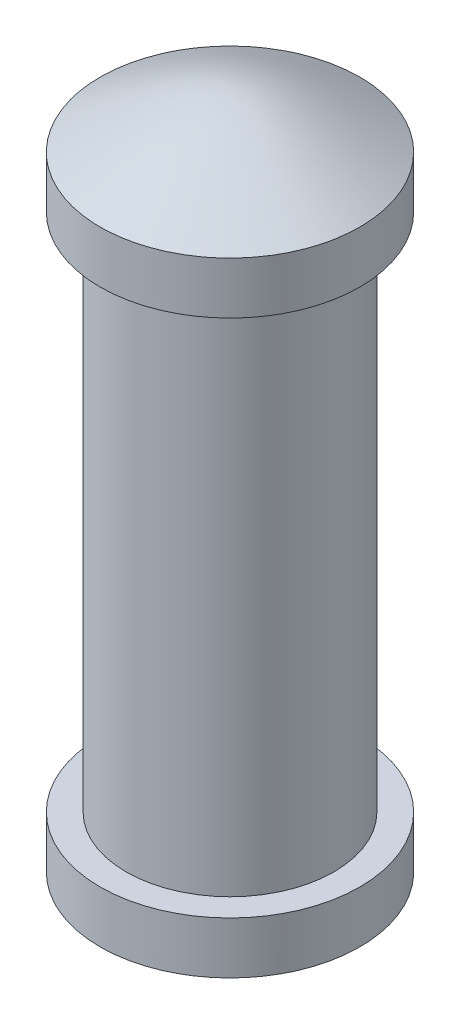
ISO-10303-21;
HEADER;
FILE_DESCRIPTION(('STEP AP214'),'2;1');
FILE_NAME('part.step','',(''),(''),'','','');
FILE_SCHEMA(('AUTOMOTIVE_DESIGN { 1 0 10303 214 1 1 1 1 }'));
ENDSEC;
DATA;
#1=APPLICATION_CONTEXT('core data for automotive mechanical design processes');
#2=APPLICATION_PROTOCOL_DEFINITION('international standard','automotive_design',2000,#1);
#3=PRODUCT_CONTEXT('',#1,'mechanical');
#4=PRODUCT('Part','Part','',(#3));
#5=PRODUCT_RELATED_PRODUCT_CATEGORY('part','',(#4));
#6=PRODUCT_DEFINITION_FORMATION('','',#4);
#7=PRODUCT_DEFINITION_CONTEXT('part definition',#1,'design');
#8=PRODUCT_DEFINITION('design','',#6,#7);
#9=PRODUCT_DEFINITION_SHAPE('','',#8);
#10=(LENGTH_UNIT() NAMED_UNIT(*) SI_UNIT(.MILLI.,.METRE.));
#11=(NAMED_UNIT(*) PLANE_ANGLE_UNIT() SI_UNIT($,.RADIAN.));
#12=(NAMED_UNIT(*) SI_UNIT($,.STERADIAN.) SOLID_ANGLE_UNIT());
#13=UNCERTAINTY_MEASURE_WITH_UNIT(LENGTH_MEASURE(1.E-05),#10,'distance_accuracy_value','');
#14=(GEOMETRIC_REPRESENTATION_CONTEXT(3) GLOBAL_UNCERTAINTY_ASSIGNED_CONTEXT((#13)) GLOBAL_UNIT_ASSIGNED_CONTEXT((#10,
#11,#12)) REPRESENTATION_CONTEXT('',''));
#15=CARTESIAN_POINT('',(0.,0.,0.));
#16=DIRECTION('',(0.,0.,1.));
#17=DIRECTION('',(1.,0.,0.));
#18=AXIS2_PLACEMENT_3D('',#15,#16,#17);
#19=CARTESIAN_POINT('',(0.,10.,0.));
#20=DIRECTION('',(0.,-1.,0.));
#21=DIRECTION('',(0.,0.,-1.));
#22=AXIS2_PLACEMENT_3D('',#19,#20,#21);
#23=CYLINDRICAL_SURFACE('',#22,2.);
#24=CARTESIAN_POINT('',(0.,10.,0.));
#25=DIRECTION('',(0.,1.,0.));
#26=DIRECTION('',(0.,0.,1.));
#27=AXIS2_PLACEMENT_3D('',#24,#25,#26);
#28=CIRCLE('',#27,2.);
#29=CARTESIAN_POINT('',(0.,10.,2.));
#30=VERTEX_POINT('',#29);
#31=EDGE_CURVE('E12',#30,#30,#28,.T.);
#32=ORIENTED_EDGE('',*,*,#31,.F.);
#33=EDGE_LOOP('',(#32));
#34=FACE_BOUND('',#33,.T.);
#35=CARTESIAN_POINT('',(0.,0.,0.));
#36=DIRECTION('',(0.,-1.,0.));
#37=DIRECTION('',(0.,0.,-1.));
#38=AXIS2_PLACEMENT_3D('',#35,#36,#37);
#39=CIRCLE('',#38,2.);
#40=CARTESIAN_POINT('',(0.,0.,-2.));
#41=VERTEX_POINT('',#40);
#42=EDGE_CURVE('E116',#41,#41,#39,.T.);
#43=ORIENTED_EDGE('',*,*,#42,.F.);
#44=EDGE_LOOP('',(#43));
#45=FACE_BOUND('',#44,.T.);
#46=ADVANCED_FACE('F90',(#34,#45),#23,.T.);
#47=CARTESIAN_POINT('',(0.,10.,0.));
#48=DIRECTION('',(0.,1.,0.));
#49=DIRECTION('',(0.,0.,1.));
#50=AXIS2_PLACEMENT_3D('',#47,#48,#49);
#51=PLANE('',#50);
#52=CARTESIAN_POINT('',(0.,10.,0.));
#53=DIRECTION('',(0.,1.,0.));
#54=DIRECTION('',(0.,0.,1.));
#55=AXIS2_PLACEMENT_3D('',#52,#53,#54);
#56=CIRCLE('',#55,2.5);
#57=CARTESIAN_POINT('',(0.,10.,2.5));
#58=VERTEX_POINT('',#57);
#59=EDGE_CURVE('E108',#58,#58,#56,.T.);
#60=ORIENTED_EDGE('',*,*,#59,.F.);
#61=EDGE_LOOP('',(#60));
#62=FACE_BOUND('',#61,.T.);
#63=ORIENTED_EDGE('',*,*,#31,.T.);
#64=EDGE_LOOP('',(#63));
#65=FACE_BOUND('',#64,.T.);
#66=ADVANCED_FACE('F135',(#62,#65),#51,.F.);
#67=CARTESIAN_POINT('',(0.,11.,0.));
#68=DIRECTION('',(0.,-1.,0.));
#69=DIRECTION('',(0.,0.,-1.));
#70=AXIS2_PLACEMENT_3D('',#67,#68,#69);
#71=CYLINDRICAL_SURFACE('',#70,2.5);
#72=CARTESIAN_POINT('',(-1.14044327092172E-12,11.000113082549,-2.5));
#73=CARTESIAN_POINT('',(-0.140426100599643,11.000114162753,-2.49999377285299));
#74=CARTESIAN_POINT('',(-0.280954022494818,11.0001492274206,-2.48812860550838));
#75=CARTESIAN_POINT('',(-0.558139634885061,11.0001417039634,-2.44096075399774));
#76=CARTESIAN_POINT('',(-0.694792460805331,11.0000990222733,-2.40562986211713));
#77=CARTESIAN_POINT('',(-0.96017207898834,11.0000759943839,-2.31253634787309));
#78=CARTESIAN_POINT('',(-1.08890262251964,11.0000956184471,-2.25478443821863));
#79=CARTESIAN_POINT('',(-1.33480471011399,11.0001398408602,-2.1185029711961));
#80=CARTESIAN_POINT('',(-1.45197911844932,11.0001644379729,-2.03997858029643));
#81=CARTESIAN_POINT('',(-1.67149628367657,11.0001917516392,-1.86436533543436));
#82=CARTESIAN_POINT('',(-1.77383749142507,11.000194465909,-1.76727454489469));
#83=CARTESIAN_POINT('',(-1.96077093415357,11.0001806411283,-1.55728556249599));
#84=CARTESIAN_POINT('',(-2.04536247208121,11.0001641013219,-1.44438675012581));
#85=CARTESIAN_POINT('',(-2.19438907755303,11.0001143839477,-1.20599186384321));
#86=CARTESIAN_POINT('',(-2.25882451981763,11.0000812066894,-1.08049602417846));
#87=CARTESIAN_POINT('',(-2.36571174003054,11.0000906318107,-0.820468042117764));
#88=CARTESIAN_POINT('',(-2.40816356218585,11.0001332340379,-0.685935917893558));
#89=CARTESIAN_POINT('',(-2.46987873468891,11.0001571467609,-0.411653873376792));
#90=CARTESIAN_POINT('',(-2.48914204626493,11.0001384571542,-0.271903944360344));
#91=CARTESIAN_POINT('',(-2.50393321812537,11.0001366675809,0.00884614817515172));
#92=CARTESIAN_POINT('',(-2.49946112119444,11.0001535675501,0.149846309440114));
#93=CARTESIAN_POINT('',(-2.46690851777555,11.0001488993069,0.429094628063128));
#94=CARTESIAN_POINT('',(-2.43882799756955,11.0001273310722,0.567342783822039));
#95=CARTESIAN_POINT('',(-2.35985560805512,11.0000960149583,0.837162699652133));
#96=CARTESIAN_POINT('',(-2.30896371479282,11.0000862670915,0.968734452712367));
#97=CARTESIAN_POINT('',(-2.18581327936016,11.0001095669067,1.22146639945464));
#98=CARTESIAN_POINT('',(-2.11355474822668,11.0001426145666,1.34262659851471));
#99=CARTESIAN_POINT('',(-1.94972226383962,11.0001836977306,1.57109609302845));
#100=CARTESIAN_POINT('',(-1.85814831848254,11.0001917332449,1.67840539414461));
#101=CARTESIAN_POINT('',(-1.65828444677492,11.0001903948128,1.87612700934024));
#102=CARTESIAN_POINT('',(-1.54999451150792,11.0001810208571,1.96653931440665));
#103=CARTESIAN_POINT('',(-1.319772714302,11.0001383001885,2.12790033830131));
#104=CARTESIAN_POINT('',(-1.19784085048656,11.0001049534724,2.19884905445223));
#105=CARTESIAN_POINT('',(-0.943796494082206,11.0000846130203,2.31926885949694));
#106=CARTESIAN_POINT('',(-0.811684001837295,11.0000976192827,2.36873994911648));
#107=CARTESIAN_POINT('',(-0.54102867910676,11.000122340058,2.44480016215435));
#108=CARTESIAN_POINT('',(-0.402485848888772,11.0001340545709,2.47138928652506));
#109=CARTESIAN_POINT('',(-0.12290271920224,11.0001328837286,2.50093078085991));
#110=CARTESIAN_POINT('',(0.0181375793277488,11.0001199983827,2.50388315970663));
#111=CARTESIAN_POINT('',(0.298711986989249,11.0001235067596,2.4860673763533));
#112=CARTESIAN_POINT('',(0.438246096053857,11.0001399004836,2.46529921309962));
#113=CARTESIAN_POINT('',(0.711847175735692,11.0001212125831,2.40063188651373));
#114=CARTESIAN_POINT('',(0.845914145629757,11.0000861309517,2.3567327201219));
#115=CARTESIAN_POINT('',(1.10477514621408,11.000085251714,2.24704956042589));
#116=CARTESIAN_POINT('',(1.22956917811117,11.0001194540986,2.18126556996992));
#117=CARTESIAN_POINT('',(1.46634175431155,11.0001683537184,2.0296801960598));
#118=CARTESIAN_POINT('',(1.57832030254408,11.0001830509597,1.94387881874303));
#119=CARTESIAN_POINT('',(1.78628326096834,11.0001942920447,1.75469426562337));
#120=CARTESIAN_POINT('',(1.88226766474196,11.0001908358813,1.65131108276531));
#121=CARTESIAN_POINT('',(2.0555176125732,11.0001602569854,1.42989762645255));
#122=CARTESIAN_POINT('',(2.13278314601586,11.0001331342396,1.31186734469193));
#123=CARTESIAN_POINT('',(2.26640187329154,11.0000928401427,1.06451039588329));
#124=CARTESIAN_POINT('',(2.322755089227,11.0000796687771,0.935183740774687));
#125=CARTESIAN_POINT('',(2.41294957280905,11.0001087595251,0.66890520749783));
#126=CARTESIAN_POINT('',(2.4467908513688,11.0001510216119,0.531953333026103));
#127=CARTESIAN_POINT('',(2.49100089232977,11.0001628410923,0.254311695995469));
#128=CARTESIAN_POINT('',(2.50136961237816,11.0001323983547,0.113621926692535));
#129=CARTESIAN_POINT('',(2.49834008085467,11.0001331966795,-0.167501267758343));
#130=CARTESIAN_POINT('',(2.48494186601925,11.0001644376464,-0.307934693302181));
#131=CARTESIAN_POINT('',(2.43475879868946,11.0001484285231,-0.584559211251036));
#132=CARTESIAN_POINT('',(2.39797389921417,11.0001011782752,-0.720750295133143));
#133=CARTESIAN_POINT('',(2.30206082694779,11.0000763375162,-0.985026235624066));
#134=CARTESIAN_POINT('',(2.24293223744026,11.0000987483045,-1.1131109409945));
#135=CARTESIAN_POINT('',(2.10401277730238,11.0001446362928,-1.35753048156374));
#136=CARTESIAN_POINT('',(2.02422271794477,11.0001681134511,-1.47386577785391));
#137=CARTESIAN_POINT('',(1.84625484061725,11.0001929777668,-1.69147835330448));
#138=CARTESIAN_POINT('',(1.74807895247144,11.0001943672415,-1.79275721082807));
#139=CARTESIAN_POINT('',(1.53608884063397,11.0001777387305,-1.97742075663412));
#140=CARTESIAN_POINT('',(1.42227073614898,11.0001597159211,-2.0608009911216));
#141=CARTESIAN_POINT('',(1.18220727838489,11.0001106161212,-2.20730096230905));
#142=CARTESIAN_POINT('',(1.05595601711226,11.0000795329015,-2.27041100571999));
#143=CARTESIAN_POINT('',(0.794749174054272,11.0000884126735,-2.3744668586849));
#144=CARTESIAN_POINT('',(0.659804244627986,11.0001282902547,-2.41543923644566));
#145=CARTESIAN_POINT('',(0.436666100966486,11.0001462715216,-2.46313677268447));
#146=CARTESIAN_POINT('',(0.349922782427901,11.0001419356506,-2.47694323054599));
#147=CARTESIAN_POINT('',(0.175466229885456,11.0001250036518,-2.49537678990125));
#148=CARTESIAN_POINT('',(0.0877529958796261,11.0001124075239,-2.50000389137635));
#149=CARTESIAN_POINT('',(-1.14044327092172E-12,11.000113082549,-2.5));
#150=B_SPLINE_CURVE_WITH_KNOTS('',3,(#72,#73,#74,#75,#76,#77,#78,#79,#80,#81,#82,#83,#84,#85,
#86,#87,#88,#89,#90,#91,#92,#93,#94,#95,#96,#97,#98,#99,#100,#101,#102,#103,#104,#105,#106,#107,
#108,#109,#110,#111,#112,#113,#114,#115,#116,#117,#118,#119,#120,#121,#122,#123,#124,#125,#126,
#127,#128,#129,#130,#131,#132,#133,#134,#135,#136,#137,#138,#139,#140,#141,#142,#143,#144,#145,
#146,#147,#148,#149),.UNSPECIFIED.,.T.,.F.,(4,2,2,2,2,2,2,2,2,2,2,2,2,2,2,2,2,2,2,2,2,2,2,2,2,2,
2,2,2,2,2,2,2,2,2,2,2,2,4),(0.,0.420958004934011,0.842422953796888,1.26368677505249,
1.68484591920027,2.10604901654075,2.52726865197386,2.94848045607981,3.36969141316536,
3.79090307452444,4.21211397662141,4.63332512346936,5.05453671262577,5.47574808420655,
5.89695928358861,6.31817070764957,6.7393821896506,7.16059365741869,7.58180510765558,
8.00301639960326,8.4242277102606,8.84543907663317,9.26665038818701,9.68786157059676,
10.1090729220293,10.5302845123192,10.9514956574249,11.3727065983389,11.7939182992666,
12.2151293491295,12.6363412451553,13.0575609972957,13.4787642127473,13.8999232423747,
14.3211869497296,14.7426518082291,15.1636097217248,15.426668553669,15.6897273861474),.UNSPECIFIED.);
#151=CARTESIAN_POINT('',(-1.14044327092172E-12,11.000113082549,-2.5));
#152=VERTEX_POINT('',#151);
#153=EDGE_CURVE('E97',#152,#152,#150,.T.);
#154=ORIENTED_EDGE('',*,*,#153,.F.);
#155=EDGE_LOOP('',(#154));
#156=FACE_BOUND('',#155,.T.);
#157=ORIENTED_EDGE('',*,*,#59,.T.);
#158=EDGE_LOOP('',(#157));
#159=FACE_BOUND('',#158,.T.);
#160=ADVANCED_FACE('F137',(#156,#159),#71,.T.);
#161=CARTESIAN_POINT('',(-2.54999771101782,10.3999640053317,-2.6333051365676));
#162=CARTESIAN_POINT('',(-2.54999771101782,10.5449084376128,-2.21197735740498));
#163=CARTESIAN_POINT('',(-2.54999771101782,10.6765914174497,-1.79064957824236));
#164=CARTESIAN_POINT('',(-2.54999771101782,10.7992991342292,-1.36932179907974));
#165=CARTESIAN_POINT('',(-2.54999771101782,10.9390975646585,-0.737329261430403));
#166=CARTESIAN_POINT('',(-2.54999771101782,10.9775866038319,-0.105336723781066));
#167=CARTESIAN_POINT('',(-2.54999771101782,10.9775868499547,0.105328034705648));
#168=CARTESIAN_POINT('',(-2.54999771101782,10.9390989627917,0.737322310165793));
#169=CARTESIAN_POINT('',(-2.54999771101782,10.7993004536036,1.36931658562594));
#170=CARTESIAN_POINT('',(-2.54999771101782,10.6765923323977,1.79064610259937));
#171=CARTESIAN_POINT('',(-2.54999771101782,10.544908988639,2.2119756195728));
#172=CARTESIAN_POINT('',(-2.54999771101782,10.3999640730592,2.63330513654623));
#173=CARTESIAN_POINT('',(-2.14199908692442,10.5330206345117,-2.6333051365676));
#174=CARTESIAN_POINT('',(-2.14199908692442,10.7005652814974,-2.21197735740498));
#175=CARTESIAN_POINT('',(-2.14199908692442,10.8546335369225,-1.79064957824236));
#176=CARTESIAN_POINT('',(-2.14199908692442,11.0007363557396,-1.36932179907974));
#177=CARTESIAN_POINT('',(-2.14199908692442,11.1685958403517,-0.737329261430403));
#178=CARTESIAN_POINT('',(-2.14199908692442,11.2149431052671,-0.105336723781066));
#179=CARTESIAN_POINT('',(-2.14199908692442,11.2149433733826,0.105328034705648));
#180=CARTESIAN_POINT('',(-2.14199908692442,11.1685974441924,0.737322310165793));
#181=CARTESIAN_POINT('',(-2.14199908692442,11.0007380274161,1.36931658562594));
#182=CARTESIAN_POINT('',(-2.14199908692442,10.8546347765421,1.79064610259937));
#183=CARTESIAN_POINT('',(-2.14199908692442,10.7005660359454,2.2119756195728));
#184=CARTESIAN_POINT('',(-2.14199908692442,10.5330207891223,2.63330513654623));
#185=CARTESIAN_POINT('',(-1.73400046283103,10.6536872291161,-2.6333051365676));
#186=CARTESIAN_POINT('',(-1.73400046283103,10.843617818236,-2.21197735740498));
#187=CARTESIAN_POINT('',(-1.73400046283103,11.0197229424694,-1.79064957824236));
#188=CARTESIAN_POINT('',(-1.73400046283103,11.1899189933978,-1.36932179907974));
#189=CARTESIAN_POINT('',(-1.73400046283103,11.3866507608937,-0.737329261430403));
#190=CARTESIAN_POINT('',(-1.73400046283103,11.4411124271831,-0.105336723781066));
#191=CARTESIAN_POINT('',(-1.73400046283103,11.4411127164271,0.105328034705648));
#192=CARTESIAN_POINT('',(-1.73400046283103,11.3866525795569,0.737322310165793));
#193=CARTESIAN_POINT('',(-1.73400046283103,11.1899210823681,1.36931658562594));
#194=CARTESIAN_POINT('',(-1.73400046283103,11.0197244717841,1.79064610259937));
#195=CARTESIAN_POINT('',(-1.73400046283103,10.8436187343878,2.2119756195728));
#196=CARTESIAN_POINT('',(-1.73400046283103,10.6536874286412,2.63330513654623));
#197=CARTESIAN_POINT('',(-1.32600183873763,10.7658198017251,-2.6333051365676));
#198=CARTESIAN_POINT('',(-1.32600183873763,10.9792502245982,-2.21197735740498));
#199=CARTESIAN_POINT('',(-1.32600183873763,11.179402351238,-1.79064957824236));
#200=CARTESIAN_POINT('',(-1.32600183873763,11.3755750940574,-1.36932179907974));
#201=CARTESIAN_POINT('',(-1.32600183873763,11.5992119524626,-0.737329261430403));
#202=CARTESIAN_POINT('',(-1.32600183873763,11.661906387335,-0.105336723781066));
#203=CARTESIAN_POINT('',(-1.32600183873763,11.6619067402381,0.105328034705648));
#204=CARTESIAN_POINT('',(-1.32600183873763,11.5992140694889,0.737322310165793));
#205=CARTESIAN_POINT('',(-1.32600183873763,11.3755776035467,1.36931658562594));
#206=CARTESIAN_POINT('',(-1.32600183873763,11.1794040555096,1.79064610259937));
#207=CARTESIAN_POINT('',(-1.32600183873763,10.9792511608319,2.2119756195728));
#208=CARTESIAN_POINT('',(-1.32600183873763,10.7658198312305,2.63330513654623));
#209=CARTESIAN_POINT('',(-0.714003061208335,10.8928490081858,-2.6333051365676));
#210=CARTESIAN_POINT('',(-0.714003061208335,11.1346212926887,-2.21197735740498));
#211=CARTESIAN_POINT('',(-0.714003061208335,11.3641556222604,-1.79064957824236));
#212=CARTESIAN_POINT('',(-0.714003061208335,11.5875411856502,-1.36932179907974));
#213=CARTESIAN_POINT('',(-0.714003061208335,11.8625327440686,-0.737329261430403));
#214=CARTESIAN_POINT('',(-0.714003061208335,11.940881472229,-0.105336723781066));
#215=CARTESIAN_POINT('',(-0.714003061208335,11.9408818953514,0.105328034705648));
#216=CARTESIAN_POINT('',(-0.714003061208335,11.8625354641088,0.737322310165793));
#217=CARTESIAN_POINT('',(-0.714003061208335,11.5875440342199,1.36931658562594));
#218=CARTESIAN_POINT('',(-0.714003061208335,11.3641575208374,1.79064610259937));
#219=CARTESIAN_POINT('',(-0.714003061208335,11.1346222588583,2.2119756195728));
#220=CARTESIAN_POINT('',(-0.714003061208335,10.8928489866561,2.63330513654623));
#221=CARTESIAN_POINT('',(-0.102004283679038,10.9276996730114,-2.6333051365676));
#222=CARTESIAN_POINT('',(-0.102004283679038,11.1774356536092,-2.21197735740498));
#223=CARTESIAN_POINT('',(-0.102004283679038,11.4152720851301,-1.79064957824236));
#224=CARTESIAN_POINT('',(-0.102004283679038,11.647060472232,-1.36932179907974));
#225=CARTESIAN_POINT('',(-0.102004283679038,11.9377378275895,-0.737329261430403));
#226=CARTESIAN_POINT('',(-0.102004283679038,12.0276624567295,-0.105336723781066));
#227=CARTESIAN_POINT('',(-0.102004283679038,12.0276629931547,0.105328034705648));
#228=CARTESIAN_POINT('',(-0.102004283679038,11.9377407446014,0.737322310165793));
#229=CARTESIAN_POINT('',(-0.102004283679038,11.647063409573,1.36931658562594));
#230=CARTESIAN_POINT('',(-0.102004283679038,11.4152740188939,1.79064610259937));
#231=CARTESIAN_POINT('',(-0.102004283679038,11.1774366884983,2.2119756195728));
#232=CARTESIAN_POINT('',(-0.102004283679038,10.9276996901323,2.63330513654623));
#233=CARTESIAN_POINT('',(0.101995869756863,10.9276998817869,-2.6333051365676));
#234=CARTESIAN_POINT('',(0.101995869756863,11.1774359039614,-2.21197735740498));
#235=CARTESIAN_POINT('',(0.101995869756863,11.4152723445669,-1.79064957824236));
#236=CARTESIAN_POINT('',(0.101995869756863,11.6470608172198,-1.36932179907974));
#237=CARTESIAN_POINT('',(0.101995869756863,11.9377382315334,-0.737329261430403));
#238=CARTESIAN_POINT('',(0.101995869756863,12.0276629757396,-0.105336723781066));
#239=CARTESIAN_POINT('',(0.101995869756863,12.0276635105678,0.105328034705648));
#240=CARTESIAN_POINT('',(0.101995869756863,11.9377411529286,0.737322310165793));
#241=CARTESIAN_POINT('',(0.101995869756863,11.6470637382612,1.36931658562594));
#242=CARTESIAN_POINT('',(0.101995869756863,11.4152743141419,1.79064610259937));
#243=CARTESIAN_POINT('',(0.101995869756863,11.1774369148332,2.2119756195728));
#244=CARTESIAN_POINT('',(0.101995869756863,10.9276998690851,2.63330513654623));
#245=CARTESIAN_POINT('',(0.713996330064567,10.8928501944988,-2.6333051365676));
#246=CARTESIAN_POINT('',(0.713996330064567,11.1346227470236,-2.21197735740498));
#247=CARTESIAN_POINT('',(0.713996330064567,11.3641574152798,-1.79064957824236));
#248=CARTESIAN_POINT('',(0.713996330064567,11.5875432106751,-1.36932179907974));
#249=CARTESIAN_POINT('',(0.713996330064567,11.8625353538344,-0.737329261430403));
#250=CARTESIAN_POINT('',(0.713996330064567,11.9408842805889,-0.105336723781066));
#251=CARTESIAN_POINT('',(0.713996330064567,11.9408847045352,0.105328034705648));
#252=CARTESIAN_POINT('',(0.713996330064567,11.8625380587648,0.737322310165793));
#253=CARTESIAN_POINT('',(0.713996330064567,11.5875460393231,1.36931658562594));
#254=CARTESIAN_POINT('',(0.713996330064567,11.3641592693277,1.79064610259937));
#255=CARTESIAN_POINT('',(0.713996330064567,11.1346237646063,2.2119756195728));
#256=CARTESIAN_POINT('',(0.713996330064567,10.8928502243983,2.63330513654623));
#257=CARTESIAN_POINT('',(1.32599679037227,10.7658212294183,-2.6333051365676));
#258=CARTESIAN_POINT('',(1.32599679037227,10.979251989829,-2.21197735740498));
#259=CARTESIAN_POINT('',(1.32599679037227,11.1794044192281,-1.79064957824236));
#260=CARTESIAN_POINT('',(1.32599679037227,11.3755774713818,-1.36932179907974));
#261=CARTESIAN_POINT('',(1.32599679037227,11.5992146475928,-0.737329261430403));
#262=CARTESIAN_POINT('',(1.32599679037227,11.6619091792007,-0.105336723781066));
#263=CARTESIAN_POINT('',(1.32599679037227,11.661909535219,0.105328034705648));
#264=CARTESIAN_POINT('',(1.32599679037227,11.5992167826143,0.737322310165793));
#265=CARTESIAN_POINT('',(1.32599679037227,11.3755799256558,1.36931658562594));
#266=CARTESIAN_POINT('',(1.32599679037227,11.1794059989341,1.79064610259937));
#267=CARTESIAN_POINT('',(1.32599679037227,10.9792528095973,2.2119756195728));
#268=CARTESIAN_POINT('',(1.32599679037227,10.7658212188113,2.63330513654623));
#269=CARTESIAN_POINT('',(1.73399709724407,10.6536883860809,-2.6333051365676));
#270=CARTESIAN_POINT('',(1.73399709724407,10.8436191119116,-2.21197735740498));
#271=CARTESIAN_POINT('',(1.73399709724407,11.0197243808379,-1.79064957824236));
#272=CARTESIAN_POINT('',(1.73399709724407,11.1899204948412,-1.36932179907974));
#273=CARTESIAN_POINT('',(1.73399709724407,11.3866524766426,-0.737329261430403));
#274=CARTESIAN_POINT('',(1.73399709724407,11.4411142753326,-0.105336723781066));
#275=CARTESIAN_POINT('',(1.73399709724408,11.4411145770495,0.105328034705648));
#276=CARTESIAN_POINT('',(1.73399709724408,11.3866544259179,0.737322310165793));
#277=CARTESIAN_POINT('',(1.73399709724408,11.1899226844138,1.36931658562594));
#278=CARTESIAN_POINT('',(1.73399709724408,11.0197257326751,1.79064610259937));
#279=CARTESIAN_POINT('',(1.73399709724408,10.8436197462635,2.2119756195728));
#280=CARTESIAN_POINT('',(1.73399709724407,10.6536881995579,2.63330513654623));
#281=CARTESIAN_POINT('',(2.14199740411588,10.5330213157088,-2.6333051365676));
#282=CARTESIAN_POINT('',(2.14199740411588,10.7005659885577,-2.21197735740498));
#283=CARTESIAN_POINT('',(2.14199740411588,10.854634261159,-1.79064957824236));
#284=CARTESIAN_POINT('',(2.14199740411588,11.0007370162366,-1.36932179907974));
#285=CARTESIAN_POINT('',(2.14199740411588,11.1685967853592,-0.737329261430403));
#286=CARTESIAN_POINT('',(2.14199740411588,11.2149440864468,-0.105336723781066));
#287=CARTESIAN_POINT('',(2.14199740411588,11.2149443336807,0.105328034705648));
#288=CARTESIAN_POINT('',(2.14199740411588,11.168598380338,0.737322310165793));
#289=CARTESIAN_POINT('',(2.14199740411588,11.0007390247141,1.36931658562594));
#290=CARTESIAN_POINT('',(2.14199740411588,10.8546355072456,1.79064610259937));
#291=CARTESIAN_POINT('',(2.14199740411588,10.7005665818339,2.2119756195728));
#292=CARTESIAN_POINT('',(2.14199740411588,10.5330211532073,2.63330513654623));
#293=CARTESIAN_POINT('',(2.54999771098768,10.3999640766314,-2.6333051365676));
#294=CARTESIAN_POINT('',(2.54999771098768,10.5449084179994,-2.21197735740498));
#295=CARTESIAN_POINT('',(2.54999771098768,10.6765912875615,-1.79064957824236));
#296=CARTESIAN_POINT('',(2.54999771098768,10.7992989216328,-1.36932179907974));
#297=CARTESIAN_POINT('',(2.54999771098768,10.9390976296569,-0.737329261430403));
#298=CARTESIAN_POINT('',(2.54999771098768,10.9775866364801,-0.105336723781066));
#299=CARTESIAN_POINT('',(2.54999771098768,10.977586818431,0.105328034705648));
#300=CARTESIAN_POINT('',(2.54999771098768,10.939098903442,0.737322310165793));
#301=CARTESIAN_POINT('',(2.54999771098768,10.7993006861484,1.36931658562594));
#302=CARTESIAN_POINT('',(2.54999771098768,10.6765924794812,1.79064610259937));
#303=CARTESIAN_POINT('',(2.54999771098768,10.5449090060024,2.2119756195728));
#304=CARTESIAN_POINT('',(2.54999771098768,10.3999639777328,2.63330513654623));
#305=B_SPLINE_SURFACE_WITH_KNOTS('',5,5,((#161,#162,#163,#164,#165,#166,#167,#168,#169,#170,
#171,#172),(#173,#174,#175,#176,#177,#178,#179,#180,#181,#182,#183,#184),(#185,#186,#187,#188,
#189,#190,#191,#192,#193,#194,#195,#196),(#197,#198,#199,#200,#201,#202,#203,#204,#205,#206,
#207,#208),(#209,#210,#211,#212,#213,#214,#215,#216,#217,#218,#219,#220),(#221,#222,#223,#224,
#225,#226,#227,#228,#229,#230,#231,#232),(#233,#234,#235,#236,#237,#238,#239,#240,#241,#242,
#243,#244),(#245,#246,#247,#248,#249,#250,#251,#252,#253,#254,#255,#256),(#257,#258,#259,#260,
#261,#262,#263,#264,#265,#266,#267,#268),(#269,#270,#271,#272,#273,#274,#275,#276,#277,#278,
#279,#280),(#281,#282,#283,#284,#285,#286,#287,#288,#289,#290,#291,#292),(#293,#294,#295,#296,
#297,#298,#299,#300,#301,#302,#303,#304)),.UNSPECIFIED.,.F.,.F.,.F.,(6,3,3,6),(6,3,3,6),
(-2.54999771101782,-0.510004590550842,0.509996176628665,2.54999771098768),(-2.6333051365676,
-0.526666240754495,0.526657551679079,2.63330513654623),.UNSPECIFIED.);
#306=ORIENTED_EDGE('',*,*,#153,.T.);
#307=EDGE_LOOP('',(#306));
#308=FACE_BOUND('',#307,.T.);
#309=ADVANCED_FACE('F92',(#308),#305,.F.);
#310=CARTESIAN_POINT('',(0.,0.,0.));
#311=DIRECTION('',(0.,-1.,0.));
#312=DIRECTION('',(0.,0.,-1.));
#313=AXIS2_PLACEMENT_3D('',#310,#311,#312);
#314=PLANE('',#313);
#315=CARTESIAN_POINT('',(0.,0.,0.));
#316=DIRECTION('',(0.,-1.,0.));
#317=DIRECTION('',(0.,0.,-1.));
#318=AXIS2_PLACEMENT_3D('',#315,#316,#317);
#319=CIRCLE('',#318,2.5);
#320=CARTESIAN_POINT('',(0.,0.,-2.5));
#321=VERTEX_POINT('',#320);
#322=EDGE_CURVE('E117',#321,#321,#319,.T.);
#323=ORIENTED_EDGE('',*,*,#322,.F.);
#324=EDGE_LOOP('',(#323));
#325=FACE_BOUND('',#324,.T.);
#326=ORIENTED_EDGE('',*,*,#42,.T.);
#327=EDGE_LOOP('',(#326));
#328=FACE_BOUND('',#327,.T.);
#329=ADVANCED_FACE('F156',(#325,#328),#314,.F.);
#330=CARTESIAN_POINT('',(0.,-1.,0.));
#331=DIRECTION('',(0.,1.,0.));
#332=DIRECTION('',(0.,0.,1.));
#333=AXIS2_PLACEMENT_3D('',#330,#331,#332);
#334=CYLINDRICAL_SURFACE('',#333,2.5);
#335=CARTESIAN_POINT('',(-1.14045193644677E-12,-1.00011308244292,2.5));
#336=CARTESIAN_POINT('',(-0.140426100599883,-1.00011416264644,2.49999377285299));
#337=CARTESIAN_POINT('',(-0.280954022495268,-1.00014922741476,2.48812860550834));
#338=CARTESIAN_POINT('',(-0.558139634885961,-1.00014170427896,2.44096075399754));
#339=CARTESIAN_POINT('',(-0.694792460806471,-1.00009902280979,2.40562986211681));
#340=CARTESIAN_POINT('',(-0.960172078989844,-1.00007599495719,2.31253634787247));
#341=CARTESIAN_POINT('',(-1.08890262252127,-1.0000956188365,2.25478443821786));
#342=CARTESIAN_POINT('',(-1.3348047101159,-1.00013984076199,2.11850297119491));
#343=CARTESIAN_POINT('',(-1.45197911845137,-1.00016443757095,2.03997858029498));
#344=CARTESIAN_POINT('',(-1.67149628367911,-1.0001917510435,1.86436533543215));
#345=CARTESIAN_POINT('',(-1.7738374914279,-1.00019446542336,1.76727454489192));
#346=CARTESIAN_POINT('',(-1.96077093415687,-1.00018064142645,1.55728556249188));
#347=CARTESIAN_POINT('',(-2.0453624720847,-1.00016410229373,1.44438675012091));
#348=CARTESIAN_POINT('',(-2.19438907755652,-1.00011438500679,1.20599186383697));
#349=CARTESIAN_POINT('',(-2.25882451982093,-1.00008120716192,1.08049602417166));
#350=CARTESIAN_POINT('',(-2.36571174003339,-1.00009063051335,0.820468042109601));
#351=CARTESIAN_POINT('',(-2.40816356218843,-1.00013323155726,0.685935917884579));
#352=CARTESIAN_POINT('',(-2.4698787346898,-1.00015714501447,0.411653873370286));
#353=CARTESIAN_POINT('',(-2.48914204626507,-1.00013845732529,0.271903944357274));
#354=CARTESIAN_POINT('',(-2.50393321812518,-1.00013666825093,-0.00884614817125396));
#355=CARTESIAN_POINT('',(-2.49946112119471,-1.0001535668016,-0.149846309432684));
#356=CARTESIAN_POINT('',(-2.46690851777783,-1.0001488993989,-0.429094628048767));
#357=CARTESIAN_POINT('',(-2.43882799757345,-1.00012733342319,-0.567342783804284));
#358=CARTESIAN_POINT('',(-2.35985560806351,-1.00009601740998,-0.837162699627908));
#359=CARTESIAN_POINT('',(-2.30896371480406,-1.00008626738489,-0.968734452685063));
#360=CARTESIAN_POINT('',(-2.18581327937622,-1.00010956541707,-1.22146639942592));
#361=CARTESIAN_POINT('',(-2.11355474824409,-1.00014261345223,-1.34262659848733));
#362=CARTESIAN_POINT('',(-1.94972226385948,-1.00018369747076,-1.57109609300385));
#363=CARTESIAN_POINT('',(-1.8581483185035,-1.00019173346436,-1.67840539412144));
#364=CARTESIAN_POINT('',(-1.65828444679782,-1.00019039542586,-1.87612700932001));
#365=CARTESIAN_POINT('',(-1.54999451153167,-1.00018102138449,-1.96653931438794));
#366=CARTESIAN_POINT('',(-1.31977271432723,-1.00013830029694,-2.12790033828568));
#367=CARTESIAN_POINT('',(-1.19784085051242,-1.00010495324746,-2.19884905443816));
#368=CARTESIAN_POINT('',(-0.943796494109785,-1.00008461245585,-2.31926885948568));
#369=CARTESIAN_POINT('',(-0.811684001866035,-1.00009761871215,-2.36873994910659));
#370=CARTESIAN_POINT('',(-0.541028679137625,-1.00012233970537,-2.44480016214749));
#371=CARTESIAN_POINT('',(-0.402485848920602,-1.00013405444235,-2.47138928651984));
#372=CARTESIAN_POINT('',(-0.122902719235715,-1.0001328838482,-2.50093078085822));
#373=CARTESIAN_POINT('',(0.0181375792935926,-1.00011999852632,-2.50388315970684));
#374=CARTESIAN_POINT('',(0.298711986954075,-1.00012350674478,-2.48606737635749));
#375=CARTESIAN_POINT('',(0.438246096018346,-1.00013990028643,-2.4652992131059));
#376=CARTESIAN_POINT('',(0.711847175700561,-1.00012121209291,-2.40063188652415));
#377=CARTESIAN_POINT('',(0.845914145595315,-1.00008613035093,-2.35673272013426));
#378=CARTESIAN_POINT('',(1.1047751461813,-1.00008525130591,-2.24704956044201));
#379=CARTESIAN_POINT('',(1.22956917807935,-1.00011945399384,-2.18126556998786));
#380=CARTESIAN_POINT('',(1.46634175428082,-1.00016835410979,-2.02968019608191));
#381=CARTESIAN_POINT('',(1.5783203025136,-1.00018305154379,-1.94387881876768));
#382=CARTESIAN_POINT('',(1.78628326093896,-1.00019429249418,-1.75469426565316));
#383=CARTESIAN_POINT('',(1.88226766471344,-1.00019083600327,-1.65131108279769));
#384=CARTESIAN_POINT('',(2.05551761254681,-1.00016025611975,-1.42989762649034));
#385=CARTESIAN_POINT('',(2.13278314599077,-1.00013313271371,-1.31186734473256));
#386=CARTESIAN_POINT('',(2.26640187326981,-1.00009283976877,-1.06451039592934));
#387=CARTESIAN_POINT('',(2.32275508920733,-1.00007967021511,-0.935183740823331));
#388=CARTESIAN_POINT('',(2.41294957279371,-1.00010876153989,-0.668905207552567));
#389=CARTESIAN_POINT('',(2.44679085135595,-1.00015102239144,-0.531953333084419));
#390=CARTESIAN_POINT('',(2.49100089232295,-1.00016284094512,-0.254311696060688));
#391=CARTESIAN_POINT('',(2.50136961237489,-1.00013239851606,-0.113621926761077));
#392=CARTESIAN_POINT('',(2.49834008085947,-1.00013319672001,0.167501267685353));
#393=CARTESIAN_POINT('',(2.48494186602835,-1.00016443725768,0.307934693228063));
#394=CARTESIAN_POINT('',(2.43475879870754,-1.0001484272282,0.584559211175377));
#395=CARTESIAN_POINT('',(2.39797389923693,-1.00010117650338,0.720750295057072));
#396=CARTESIAN_POINT('',(2.3020608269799,-1.00007633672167,0.985026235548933));
#397=CARTESIAN_POINT('',(2.24293223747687,-1.00009874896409,1.11311094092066));
#398=CARTESIAN_POINT('',(2.10401277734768,-1.00014463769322,1.35753048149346));
#399=CARTESIAN_POINT('',(2.02422271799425,-1.00016811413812,1.47386577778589));
#400=CARTESIAN_POINT('',(1.84625484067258,-1.00019297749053,1.69147835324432));
#401=CARTESIAN_POINT('',(1.748078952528,-1.00019436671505,1.79275721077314));
#402=CARTESIAN_POINT('',(1.53608884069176,-1.00017773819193,1.97742075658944));
#403=CARTESIAN_POINT('',(1.42227073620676,-1.00015971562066,2.06080099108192));
#404=CARTESIAN_POINT('',(1.18220727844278,-1.00011061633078,2.20730096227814));
#405=CARTESIAN_POINT('',(1.05595601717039,-1.00007953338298,2.27041100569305));
#406=CARTESIAN_POINT('',(0.794749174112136,-1.00008841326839,2.37446685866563));
#407=CARTESIAN_POINT('',(0.659804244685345,-1.00012829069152,2.41543923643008));
#408=CARTESIAN_POINT('',(0.436666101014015,-1.00014627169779,2.46313677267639));
#409=CARTESIAN_POINT('',(0.349922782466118,-1.00014193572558,2.47694323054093));
#410=CARTESIAN_POINT('',(0.175466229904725,-1.00012500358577,2.49537678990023));
#411=CARTESIAN_POINT('',(0.0877529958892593,-1.00011240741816,2.50000389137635));
#412=CARTESIAN_POINT('',(-1.14045193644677E-12,-1.00011308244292,2.5));
#413=B_SPLINE_CURVE_WITH_KNOTS('',3,(#335,#336,#337,#338,#339,#340,#341,#342,#343,#344,#345,
#346,#347,#348,#349,#350,#351,#352,#353,#354,#355,#356,#357,#358,#359,#360,#361,#362,#363,#364,
#365,#366,#367,#368,#369,#370,#371,#372,#373,#374,#375,#376,#377,#378,#379,#380,#381,#382,#383,
#384,#385,#386,#387,#388,#389,#390,#391,#392,#393,#394,#395,#396,#397,#398,#399,#400,#401,#402,
#403,#404,#405,#406,#407,#408,#409,#410,#411,#412),.UNSPECIFIED.,.T.,.F.,(4,2,2,2,2,2,2,2,2,2,2,
2,2,2,2,2,2,2,2,2,2,2,2,2,2,2,2,2,2,2,2,2,2,2,2,2,2,2,4),(0.,0.42095800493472,0.842422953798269,
1.26368677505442,1.68484591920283,2.10604901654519,2.52726865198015,2.94848045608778,
3.36969141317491,3.79090307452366,4.21211397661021,4.6333251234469,5.05453671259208,
5.47574808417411,5.89695928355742,6.31817070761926,6.7393821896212,7.16059365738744,
7.58180510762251,8.00301639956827,8.42422771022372,8.84543907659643,9.26665038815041,
9.68786157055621,10.1090729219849,10.5302845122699,10.9514956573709,11.3727065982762,
11.793918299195,12.2151293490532,12.6363412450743,13.0575609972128,13.4787642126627,
13.8999232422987,14.3211869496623,14.7426518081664,15.1636097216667,15.4266685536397,
15.6897273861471),.UNSPECIFIED.);
#414=CARTESIAN_POINT('',(-1.14045193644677E-12,-1.00011308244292,2.5));
#415=VERTEX_POINT('',#414);
#416=EDGE_CURVE('E111',#415,#415,#413,.T.);
#417=ORIENTED_EDGE('',*,*,#416,.F.);
#418=EDGE_LOOP('',(#417));
#419=FACE_BOUND('',#418,.T.);
#420=ORIENTED_EDGE('',*,*,#322,.T.);
#421=EDGE_LOOP('',(#420));
#422=FACE_BOUND('',#421,.T.);
#423=ADVANCED_FACE('F118',(#419,#422),#334,.T.);
#424=CARTESIAN_POINT('',(-2.54999771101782,-0.399964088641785,-2.63330513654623));
#425=CARTESIAN_POINT('',(-2.54999771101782,-0.544908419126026,-2.21197735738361));
#426=CARTESIAN_POINT('',(-2.54999771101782,-0.676591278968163,-1.79064957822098));
#427=CARTESIAN_POINT('',(-2.54999771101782,-0.799298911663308,-1.36932179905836));
#428=CARTESIAN_POINT('',(-2.54999771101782,-0.939097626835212,-0.737329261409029));
#429=CARTESIAN_POINT('',(-2.54999771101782,-0.977586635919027,-0.105336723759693));
#430=CARTESIAN_POINT('',(-2.54999771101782,-0.977586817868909,0.105328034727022));
#431=CARTESIAN_POINT('',(-2.54999771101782,-0.939098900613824,0.737322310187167));
#432=CARTESIAN_POINT('',(-2.54999771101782,-0.799300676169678,1.36931658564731));
#433=CARTESIAN_POINT('',(-2.54999771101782,-0.676592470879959,1.79064610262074));
#434=CARTESIAN_POINT('',(-2.54999771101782,-0.544909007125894,2.21197561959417));
#435=CARTESIAN_POINT('',(-2.54999771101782,-0.399963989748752,2.6333051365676));
#436=CARTESIAN_POINT('',(-2.14199908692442,-0.533020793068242,-2.63330513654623));
#437=CARTESIAN_POINT('',(-2.14199908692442,-0.700565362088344,-2.21197735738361));
#438=CARTESIAN_POINT('',(-2.14199908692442,-0.854633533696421,-1.79064957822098));
#439=CARTESIAN_POINT('',(-2.14199908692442,-1.00073618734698,-1.36932179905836));
#440=CARTESIAN_POINT('',(-2.14199908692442,-1.16859584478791,-0.737329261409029));
#441=CARTESIAN_POINT('',(-2.14199908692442,-1.21494311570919,-0.105336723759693));
#442=CARTESIAN_POINT('',(-2.14199908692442,-1.21494336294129,0.105328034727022));
#443=CARTESIAN_POINT('',(-2.14199908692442,-1.16859743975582,0.737322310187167));
#444=CARTESIAN_POINT('',(-2.14199908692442,-1.00073819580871,1.36931658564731));
#445=CARTESIAN_POINT('',(-2.14199908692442,-0.854634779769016,1.79064610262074));
#446=CARTESIAN_POINT('',(-2.14199908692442,-0.70056595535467,2.21197561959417));
#447=CARTESIAN_POINT('',(-2.14199908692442,-0.533020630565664,2.6333051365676));
#448=CARTESIAN_POINT('',(-1.73400046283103,-0.65368742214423,-2.63330513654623));
#449=CARTESIAN_POINT('',(-1.73400046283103,-0.843617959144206,-2.21197735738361));
#450=CARTESIAN_POINT('',(-1.73400046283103,-1.01972303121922,-1.79064957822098));
#451=CARTESIAN_POINT('',(-1.73400046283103,-1.189918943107,-1.36932179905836));
#452=CARTESIAN_POINT('',(-1.73400046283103,-1.38665069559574,-0.737329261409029));
#453=CARTESIAN_POINT('',(-1.73400046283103,-1.44111242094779,-0.105336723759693));
#454=CARTESIAN_POINT('',(-1.73400046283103,-1.44111272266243,0.105328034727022));
#455=CARTESIAN_POINT('',(-1.73400046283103,-1.3866526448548,0.737322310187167));
#456=CARTESIAN_POINT('',(-1.73400046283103,-1.1899211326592,1.36931658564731));
#457=CARTESIAN_POINT('',(-1.73400046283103,-1.01972438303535,1.79064610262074));
#458=CARTESIAN_POINT('',(-1.73400046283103,-0.84361859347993,2.21197561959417));
#459=CARTESIAN_POINT('',(-1.73400046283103,-0.653687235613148,2.6333051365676));
#460=CARTESIAN_POINT('',(-1.32600183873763,-0.765819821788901,-2.63330513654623));
#461=CARTESIAN_POINT('',(-1.32600183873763,-0.979250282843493,-2.21197735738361));
#462=CARTESIAN_POINT('',(-1.32600183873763,-1.17940241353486,-1.79064957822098));
#463=CARTESIAN_POINT('',(-1.32600183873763,-1.37557512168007,-1.36932179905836));
#464=CARTESIAN_POINT('',(-1.32600183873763,-1.59921194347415,-0.737329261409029));
#465=CARTESIAN_POINT('',(-1.32600183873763,-1.66190638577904,-0.105336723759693));
#466=CARTESIAN_POINT('',(-1.32600183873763,-1.66190674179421,0.105328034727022));
#467=CARTESIAN_POINT('',(-1.32600183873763,-1.59921407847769,0.737322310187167));
#468=CARTESIAN_POINT('',(-1.32600183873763,-1.37557757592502,1.36931658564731));
#469=CARTESIAN_POINT('',(-1.32600183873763,-1.17940399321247,1.79064610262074));
#470=CARTESIAN_POINT('',(-1.32600183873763,-0.979251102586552,2.21197561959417));
#471=CARTESIAN_POINT('',(-1.32600183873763,-0.765819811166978,2.6333051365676));
#472=CARTESIAN_POINT('',(-0.714003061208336,-0.892848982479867,-2.63330513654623));
#473=CARTESIAN_POINT('',(-0.714003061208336,-1.13462126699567,-2.21197735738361));
#474=CARTESIAN_POINT('',(-0.714003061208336,-1.3641556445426,-1.79064957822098));
#475=CARTESIAN_POINT('',(-0.714003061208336,-1.58754119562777,-1.36932179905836));
#476=CARTESIAN_POINT('',(-0.714003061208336,-1.86253275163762,-0.737329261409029));
#477=CARTESIAN_POINT('',(-0.714003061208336,-1.94088147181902,-0.105336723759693));
#478=CARTESIAN_POINT('',(-0.714003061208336,-1.94088189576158,0.105328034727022));
#479=CARTESIAN_POINT('',(-0.714003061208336,-1.86253545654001,0.737322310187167));
#480=CARTESIAN_POINT('',(-0.714003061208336,-1.58754402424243,1.36931658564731));
#481=CARTESIAN_POINT('',(-0.714003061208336,-1.36415749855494,1.79064610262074));
#482=CARTESIAN_POINT('',(-0.714003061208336,-1.13462228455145,2.21197561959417));
#483=CARTESIAN_POINT('',(-0.714003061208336,-0.892849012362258,2.6333051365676));
#484=CARTESIAN_POINT('',(-0.10200428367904,-0.927699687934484,-2.63330513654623));
#485=CARTESIAN_POINT('',(-0.10200428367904,-1.17743566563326,-2.21197735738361));
#486=CARTESIAN_POINT('',(-0.10200428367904,-1.41527206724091,-1.79064957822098));
#487=CARTESIAN_POINT('',(-0.10200428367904,-1.64706048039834,-1.36932179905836));
#488=CARTESIAN_POINT('',(-0.10200428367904,-1.93773782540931,-0.737329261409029));
#489=CARTESIAN_POINT('',(-0.10200428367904,-2.02766245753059,-0.105336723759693));
#490=CARTESIAN_POINT('',(-0.10200428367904,-2.02766299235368,0.105328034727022));
#491=CARTESIAN_POINT('',(-0.10200428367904,-1.93774074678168,0.737322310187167));
#492=CARTESIAN_POINT('',(-0.10200428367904,-1.64706340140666,1.36931658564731));
#493=CARTESIAN_POINT('',(-0.10200428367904,-1.41527403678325,1.79064610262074));
#494=CARTESIAN_POINT('',(-0.10200428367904,-1.17743667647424,2.21197561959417));
#495=CARTESIAN_POINT('',(-0.10200428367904,-0.927699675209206,2.6333051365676));
#496=CARTESIAN_POINT('',(0.101995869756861,-0.927699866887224,-2.63330513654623));
#497=CARTESIAN_POINT('',(0.101995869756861,-1.17743589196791,-2.21197735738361));
#498=CARTESIAN_POINT('',(0.101995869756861,-1.41527236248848,-1.79064957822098));
#499=CARTESIAN_POINT('',(0.101995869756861,-1.64706080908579,-1.36932179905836));
#500=CARTESIAN_POINT('',(0.101995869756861,-1.93773823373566,-0.737329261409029));
#501=CARTESIAN_POINT('',(0.101995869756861,-2.0276629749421,-0.105336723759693));
#502=CARTESIAN_POINT('',(0.101995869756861,-2.0276635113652,0.105328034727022));
#503=CARTESIAN_POINT('',(0.101995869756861,-1.93774115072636,0.737322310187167));
#504=CARTESIAN_POINT('',(0.101995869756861,-1.64706374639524,1.36931658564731));
#505=CARTESIAN_POINT('',(0.101995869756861,-1.4152742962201,1.79064610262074));
#506=CARTESIAN_POINT('',(0.101995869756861,-1.1774369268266,2.21197561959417));
#507=CARTESIAN_POINT('',(0.101995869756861,-0.927699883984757,2.6333051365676));
#508=CARTESIAN_POINT('',(0.713996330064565,-0.892850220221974,-2.63330513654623));
#509=CARTESIAN_POINT('',(0.713996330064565,-1.13462277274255,-2.21197735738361));
#510=CARTESIAN_POINT('',(0.713996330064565,-1.36415739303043,-1.79064957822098));
#511=CARTESIAN_POINT('',(0.713996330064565,-1.58754320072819,-1.36932179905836));
#512=CARTESIAN_POINT('',(0.713996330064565,-1.8625353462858,-0.737329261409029));
#513=CARTESIAN_POINT('',(0.713996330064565,-1.94088428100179,-0.105336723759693));
#514=CARTESIAN_POINT('',(0.713996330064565,-1.9408847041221,0.105328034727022));
#515=CARTESIAN_POINT('',(0.713996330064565,-1.86253806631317,0.737322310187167));
#516=CARTESIAN_POINT('',(0.713996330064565,-1.58754604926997,1.36931658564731));
#517=CARTESIAN_POINT('',(0.713996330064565,-1.36415929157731,1.79064610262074));
#518=CARTESIAN_POINT('',(0.713996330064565,-1.1346237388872,2.21197561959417));
#519=CARTESIAN_POINT('',(0.713996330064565,-0.892850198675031,2.6333051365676));
#520=CARTESIAN_POINT('',(1.32599679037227,-0.765821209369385,-2.63330513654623));
#521=CARTESIAN_POINT('',(1.32599679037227,-0.979251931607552,-2.21197735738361));
#522=CARTESIAN_POINT('',(1.32599679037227,-1.17940435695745,-1.79064957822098));
#523=CARTESIAN_POINT('',(1.32599679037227,-1.3755774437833,-1.36932179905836));
#524=CARTESIAN_POINT('',(1.32599679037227,-1.59921465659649,-0.737329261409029));
#525=CARTESIAN_POINT('',(1.32599679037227,-1.66190918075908,-0.105336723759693));
#526=CARTESIAN_POINT('',(1.32599679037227,-1.66190953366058,0.105328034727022));
#527=CARTESIAN_POINT('',(1.32599679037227,-1.59921677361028,0.737322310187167));
#528=CARTESIAN_POINT('',(1.32599679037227,-1.37557995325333,1.36931658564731));
#529=CARTESIAN_POINT('',(1.32599679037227,-1.17940606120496,1.79064610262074));
#530=CARTESIAN_POINT('',(1.32599679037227,-0.979252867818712,2.21197561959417));
#531=CARTESIAN_POINT('',(1.32599679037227,-0.765821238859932,2.6333051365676));
#532=CARTESIAN_POINT('',(1.73399709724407,-0.653688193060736,-2.63330513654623));
#533=CARTESIAN_POINT('',(1.73399709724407,-0.843618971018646,-2.21197735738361));
#534=CARTESIAN_POINT('',(1.73399709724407,-1.01972429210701,-1.79064957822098));
#535=CARTESIAN_POINT('',(1.73399709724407,-1.18992054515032,-1.36932179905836));
#536=CARTESIAN_POINT('',(1.73399709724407,-1.3866525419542,-0.737329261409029));
#537=CARTESIAN_POINT('',(1.73399709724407,-1.44111428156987,-0.105336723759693));
#538=CARTESIAN_POINT('',(1.73399709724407,-1.44111457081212,0.105328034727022));
#539=CARTESIAN_POINT('',(1.73399709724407,-1.38665436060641,0.737322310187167));
#540=CARTESIAN_POINT('',(1.73399709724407,-1.18992263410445,1.36931658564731));
#541=CARTESIAN_POINT('',(1.73399709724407,-1.01972582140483,1.79064610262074));
#542=CARTESIAN_POINT('',(1.73399709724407,-0.843619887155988,2.21197561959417));
#543=CARTESIAN_POINT('',(1.73399709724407,-0.653688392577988,2.6333051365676));
#544=CARTESIAN_POINT('',(2.14199740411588,-0.533021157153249,-2.63330513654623));
#545=CARTESIAN_POINT('',(2.14199740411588,-0.700565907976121,-2.21197735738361));
#546=CARTESIAN_POINT('',(2.14199740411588,-0.854634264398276,-1.79064957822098));
#547=CARTESIAN_POINT('',(2.14199740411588,-1.00073718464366,-1.36932179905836));
#548=CARTESIAN_POINT('',(2.14199740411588,-1.16859678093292,-0.737329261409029));
#549=CARTESIAN_POINT('',(2.14199740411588,-1.21494407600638,-0.105336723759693));
#550=CARTESIAN_POINT('',(2.14199740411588,-1.21494434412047,0.105328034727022));
#551=CARTESIAN_POINT('',(2.14199740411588,-1.16859838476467,0.737322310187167));
#552=CARTESIAN_POINT('',(2.14199740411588,-1.00073885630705,1.36931658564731));
#553=CARTESIAN_POINT('',(2.14199740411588,-0.854635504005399,1.79064610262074));
#554=CARTESIAN_POINT('',(2.14199740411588,-0.700566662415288,2.21197561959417));
#555=CARTESIAN_POINT('',(2.14199740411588,-0.533021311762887,2.6333051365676));
#556=CARTESIAN_POINT('',(2.54999771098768,-0.399963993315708,-2.63330513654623));
#557=CARTESIAN_POINT('',(2.54999771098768,-0.544908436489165,-2.21197735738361));
#558=CARTESIAN_POINT('',(2.54999771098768,-0.676591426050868,-1.79064957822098));
#559=CARTESIAN_POINT('',(2.54999771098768,-0.799299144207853,-1.36932179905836));
#560=CARTESIAN_POINT('',(2.54999771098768,-0.939097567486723,-0.737329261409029));
#561=CARTESIAN_POINT('',(2.54999771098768,-0.977586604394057,-0.105336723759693));
#562=CARTESIAN_POINT('',(2.54999771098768,-0.97758685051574,0.105328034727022));
#563=CARTESIAN_POINT('',(2.54999771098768,-0.939098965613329,0.737322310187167));
#564=CARTESIAN_POINT('',(2.54999771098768,-0.799300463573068,1.36931658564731));
#565=CARTESIAN_POINT('',(2.54999771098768,-0.676592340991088,1.79064610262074));
#566=CARTESIAN_POINT('',(2.54999771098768,-0.544908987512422,2.21197561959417));
#567=CARTESIAN_POINT('',(2.54999771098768,-0.399964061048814,2.6333051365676));
#568=B_SPLINE_SURFACE_WITH_KNOTS('',5,5,((#424,#425,#426,#427,#428,#429,#430,#431,#432,#433,
#434,#435),(#436,#437,#438,#439,#440,#441,#442,#443,#444,#445,#446,#447),(#448,#449,#450,#451,
#452,#453,#454,#455,#456,#457,#458,#459),(#460,#461,#462,#463,#464,#465,#466,#467,#468,#469,
#470,#471),(#472,#473,#474,#475,#476,#477,#478,#479,#480,#481,#482,#483),(#484,#485,#486,#487,
#488,#489,#490,#491,#492,#493,#494,#495),(#496,#497,#498,#499,#500,#501,#502,#503,#504,#505,
#506,#507),(#508,#509,#510,#511,#512,#513,#514,#515,#516,#517,#518,#519),(#520,#521,#522,#523,
#524,#525,#526,#527,#528,#529,#530,#531),(#532,#533,#534,#535,#536,#537,#538,#539,#540,#541,
#542,#543),(#544,#545,#546,#547,#548,#549,#550,#551,#552,#553,#554,#555),(#556,#557,#558,#559,
#560,#561,#562,#563,#564,#565,#566,#567)),.UNSPECIFIED.,.F.,.F.,.F.,(6,3,3,6),(6,3,3,6),
(-2.54999771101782,-0.510004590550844,0.509996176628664,2.54999771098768),(-2.63330513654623,
-0.526666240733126,0.52665755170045,2.6333051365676),.UNSPECIFIED.);
#569=ORIENTED_EDGE('',*,*,#416,.T.);
#570=EDGE_LOOP('',(#569));
#571=FACE_BOUND('',#570,.T.);
#572=ADVANCED_FACE('F122',(#571),#568,.T.);
#573=CLOSED_SHELL('',(#46,#66,#160,#309,#329,#423,#572));
#574=MANIFOLD_SOLID_BREP('B2',#573);
#575=ADVANCED_BREP_SHAPE_REPRESENTATION('',(#18,#574),#14);
#576=SHAPE_DEFINITION_REPRESENTATION(#9,#575);
ENDSEC;
END-ISO-10303-21;
